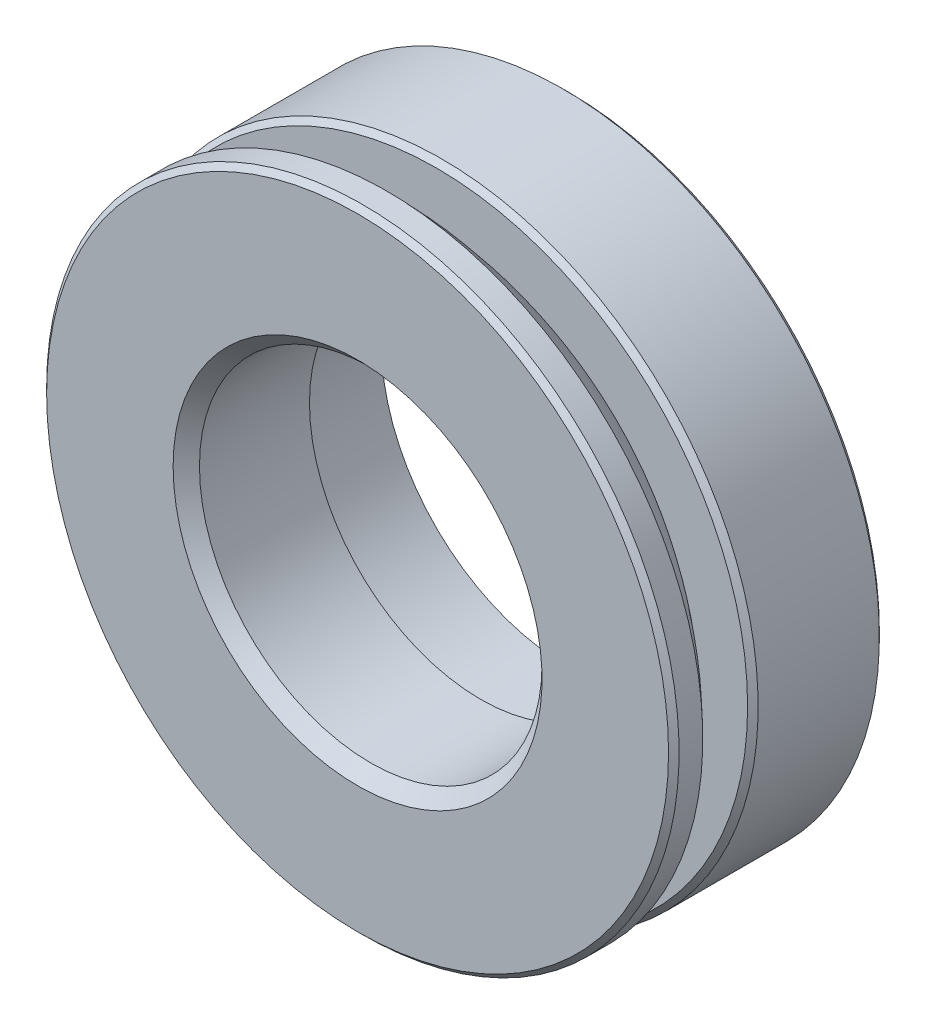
ISO-10303-21;
HEADER;
FILE_DESCRIPTION(('STEP AP214'),'2;1');
FILE_NAME('part.step','',(''),(''),'','','');
FILE_SCHEMA(('AUTOMOTIVE_DESIGN { 1 0 10303 214 1 1 1 1 }'));
ENDSEC;
DATA;
#1=APPLICATION_CONTEXT('core data for automotive mechanical design processes');
#2=APPLICATION_PROTOCOL_DEFINITION('international standard','automotive_design',2000,#1);
#3=PRODUCT_CONTEXT('',#1,'mechanical');
#4=PRODUCT('Part','Part','',(#3));
#5=PRODUCT_RELATED_PRODUCT_CATEGORY('part','',(#4));
#6=PRODUCT_DEFINITION_FORMATION('','',#4);
#7=PRODUCT_DEFINITION_CONTEXT('part definition',#1,'design');
#8=PRODUCT_DEFINITION('design','',#6,#7);
#9=PRODUCT_DEFINITION_SHAPE('','',#8);
#10=(LENGTH_UNIT() NAMED_UNIT(*) SI_UNIT(.MILLI.,.METRE.));
#11=(NAMED_UNIT(*) PLANE_ANGLE_UNIT() SI_UNIT($,.RADIAN.));
#12=(NAMED_UNIT(*) SI_UNIT($,.STERADIAN.) SOLID_ANGLE_UNIT());
#13=UNCERTAINTY_MEASURE_WITH_UNIT(LENGTH_MEASURE(1.E-05),#10,'distance_accuracy_value','');
#14=(GEOMETRIC_REPRESENTATION_CONTEXT(3) GLOBAL_UNCERTAINTY_ASSIGNED_CONTEXT((#13)) GLOBAL_UNIT_ASSIGNED_CONTEXT((#10,
#11,#12)) REPRESENTATION_CONTEXT('',''));
#15=CARTESIAN_POINT('',(0.,0.,0.));
#16=DIRECTION('',(0.,0.,1.));
#17=DIRECTION('',(1.,0.,0.));
#18=AXIS2_PLACEMENT_3D('',#15,#16,#17);
#19=CARTESIAN_POINT('',(6.5,0.,3.32568421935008));
#20=DIRECTION('',(0.,0.,1.));
#21=DIRECTION('',(-1.,0.,0.));
#22=AXIS2_PLACEMENT_3D('',#19,#20,#21);
#23=PLANE('',#22);
#24=CARTESIAN_POINT('',(0.,0.,3.32568421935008));
#25=DIRECTION('',(0.,0.,1.));
#26=DIRECTION('',(-1.,0.,0.));
#27=AXIS2_PLACEMENT_3D('',#24,#25,#26);
#28=CIRCLE('',#27,7.1);
#29=CARTESIAN_POINT('',(-7.1,0.,3.32568421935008));
#30=VERTEX_POINT('',#29);
#31=EDGE_CURVE('E8',#30,#30,#28,.T.);
#32=ORIENTED_EDGE('',*,*,#31,.F.);
#33=EDGE_LOOP('',(#32));
#34=FACE_BOUND('',#33,.T.);
#35=CARTESIAN_POINT('',(0.,0.,3.32568421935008));
#36=DIRECTION('',(0.,0.,1.));
#37=DIRECTION('',(-1.,0.,0.));
#38=AXIS2_PLACEMENT_3D('',#35,#36,#37);
#39=CIRCLE('',#38,6.5);
#40=CARTESIAN_POINT('',(-6.5,0.,3.32568421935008));
#41=VERTEX_POINT('',#40);
#42=EDGE_CURVE('E56',#41,#41,#39,.T.);
#43=ORIENTED_EDGE('',*,*,#42,.T.);
#44=EDGE_LOOP('',(#43));
#45=FACE_BOUND('',#44,.T.);
#46=ADVANCED_FACE('F13',(#34,#45),#23,.F.);
#47=CARTESIAN_POINT('',(0.,0.,10.4256842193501));
#48=DIRECTION('',(0.,0.,1.));
#49=DIRECTION('',(-1.,0.,0.));
#50=AXIS2_PLACEMENT_3D('',#47,#48,#49);
#51=CYLINDRICAL_SURFACE('',#50,7.1);
#52=CARTESIAN_POINT('',(0.,0.,0.));
#53=DIRECTION('',(0.,0.,1.));
#54=DIRECTION('',(-1.,0.,0.));
#55=AXIS2_PLACEMENT_3D('',#52,#53,#54);
#56=CIRCLE('',#55,7.1);
#57=CARTESIAN_POINT('',(-7.1,0.,0.));
#58=VERTEX_POINT('',#57);
#59=EDGE_CURVE('E19',#58,#58,#56,.T.);
#60=ORIENTED_EDGE('',*,*,#59,.F.);
#61=EDGE_LOOP('',(#60));
#62=FACE_BOUND('',#61,.T.);
#63=ORIENTED_EDGE('',*,*,#31,.T.);
#64=EDGE_LOOP('',(#63));
#65=FACE_BOUND('',#64,.T.);
#66=ADVANCED_FACE('F123',(#62,#65),#51,.F.);
#67=CARTESIAN_POINT('',(7.1,0.,0.));
#68=DIRECTION('',(0.,0.,1.));
#69=DIRECTION('',(-1.,0.,0.));
#70=AXIS2_PLACEMENT_3D('',#67,#68,#69);
#71=PLANE('',#70);
#72=CARTESIAN_POINT('',(0.,0.,0.));
#73=DIRECTION('',(0.,0.,1.));
#74=DIRECTION('',(-1.,0.,0.));
#75=AXIS2_PLACEMENT_3D('',#72,#73,#74);
#76=CIRCLE('',#75,11.8);
#77=CARTESIAN_POINT('',(-11.8,0.,0.));
#78=VERTEX_POINT('',#77);
#79=EDGE_CURVE('E23',#78,#78,#76,.T.);
#80=ORIENTED_EDGE('',*,*,#79,.F.);
#81=EDGE_LOOP('',(#80));
#82=FACE_BOUND('',#81,.T.);
#83=ORIENTED_EDGE('',*,*,#59,.T.);
#84=EDGE_LOOP('',(#83));
#85=FACE_BOUND('',#84,.T.);
#86=ADVANCED_FACE('F118',(#82,#85),#71,.F.);
#87=CARTESIAN_POINT('',(0.,0.,0.));
#88=DIRECTION('',(0.,0.,1.));
#89=DIRECTION('',(-1.,0.,0.));
#90=AXIS2_PLACEMENT_3D('',#87,#88,#89);
#91=CONICAL_SURFACE('',#90,11.8,0.785398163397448);
#92=CARTESIAN_POINT('',(0.,0.,0.2));
#93=DIRECTION('',(0.,0.,1.));
#94=DIRECTION('',(-1.,0.,0.));
#95=AXIS2_PLACEMENT_3D('',#92,#93,#94);
#96=CIRCLE('',#95,12.);
#97=CARTESIAN_POINT('',(-12.,0.,0.2));
#98=VERTEX_POINT('',#97);
#99=EDGE_CURVE('E27',#98,#98,#96,.T.);
#100=ORIENTED_EDGE('',*,*,#99,.F.);
#101=EDGE_LOOP('',(#100));
#102=FACE_BOUND('',#101,.T.);
#103=ORIENTED_EDGE('',*,*,#79,.T.);
#104=EDGE_LOOP('',(#103));
#105=FACE_BOUND('',#104,.T.);
#106=ADVANCED_FACE('F112',(#102,#105),#91,.T.);
#107=CARTESIAN_POINT('',(0.,0.,10.4256842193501));
#108=DIRECTION('',(0.,0.,1.));
#109=DIRECTION('',(-1.,0.,0.));
#110=AXIS2_PLACEMENT_3D('',#107,#108,#109);
#111=CYLINDRICAL_SURFACE('',#110,12.);
#112=CARTESIAN_POINT('',(0.,0.,4.8));
#113=DIRECTION('',(0.,0.,1.));
#114=DIRECTION('',(-1.,0.,0.));
#115=AXIS2_PLACEMENT_3D('',#112,#113,#114);
#116=CIRCLE('',#115,12.);
#117=CARTESIAN_POINT('',(-12.,0.,4.8));
#118=VERTEX_POINT('',#117);
#119=EDGE_CURVE('E32',#118,#118,#116,.T.);
#120=ORIENTED_EDGE('',*,*,#119,.F.);
#121=EDGE_LOOP('',(#120));
#122=FACE_BOUND('',#121,.T.);
#123=ORIENTED_EDGE('',*,*,#99,.T.);
#124=EDGE_LOOP('',(#123));
#125=FACE_BOUND('',#124,.T.);
#126=ADVANCED_FACE('F106',(#122,#125),#111,.T.);
#127=CARTESIAN_POINT('',(0.,0.,4.8));
#128=DIRECTION('',(0.,0.,-1.));
#129=DIRECTION('',(1.,0.,0.));
#130=AXIS2_PLACEMENT_3D('',#127,#128,#129);
#131=CONICAL_SURFACE('',#130,12.,0.785398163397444);
#132=CARTESIAN_POINT('',(0.,0.,5.));
#133=DIRECTION('',(0.,0.,1.));
#134=DIRECTION('',(-1.,0.,0.));
#135=AXIS2_PLACEMENT_3D('',#132,#133,#134);
#136=CIRCLE('',#135,11.8);
#137=CARTESIAN_POINT('',(-11.8,0.,5.));
#138=VERTEX_POINT('',#137);
#139=EDGE_CURVE('E35',#138,#138,#136,.T.);
#140=ORIENTED_EDGE('',*,*,#139,.F.);
#141=EDGE_LOOP('',(#140));
#142=FACE_BOUND('',#141,.T.);
#143=ORIENTED_EDGE('',*,*,#119,.T.);
#144=EDGE_LOOP('',(#143));
#145=FACE_BOUND('',#144,.T.);
#146=ADVANCED_FACE('F100',(#142,#145),#131,.T.);
#147=CARTESIAN_POINT('',(9.72824780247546,0.,5.));
#148=DIRECTION('',(0.,0.,-1.));
#149=DIRECTION('',(1.,0.,0.));
#150=AXIS2_PLACEMENT_3D('',#147,#148,#149);
#151=PLANE('',#150);
#152=CARTESIAN_POINT('',(0.,0.,5.));
#153=DIRECTION('',(0.,0.,1.));
#154=DIRECTION('',(-1.,0.,0.));
#155=AXIS2_PLACEMENT_3D('',#152,#153,#154);
#156=CIRCLE('',#155,9.72824780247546);
#157=CARTESIAN_POINT('',(-9.72824780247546,0.,5.));
#158=VERTEX_POINT('',#157);
#159=EDGE_CURVE('E38',#158,#158,#156,.T.);
#160=ORIENTED_EDGE('',*,*,#159,.F.);
#161=EDGE_LOOP('',(#160));
#162=FACE_BOUND('',#161,.T.);
#163=ORIENTED_EDGE('',*,*,#139,.T.);
#164=EDGE_LOOP('',(#163));
#165=FACE_BOUND('',#164,.T.);
#166=ADVANCED_FACE('F94',(#162,#165),#151,.F.);
#167=CARTESIAN_POINT('',(0.,0.,18.9408101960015));
#168=DIRECTION('',(0.,0.,1.));
#169=DIRECTION('',(-1.,0.,0.));
#170=AXIS2_PLACEMENT_3D('',#167,#168,#169);
#171=DEGENERATE_TOROIDAL_SURFACE('',#170,0.000771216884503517,17.,.F.);
#172=CARTESIAN_POINT('',(0.,0.,6.89998421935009));
#173=DIRECTION('',(0.,0.,1.));
#174=DIRECTION('',(-1.,0.,0.));
#175=AXIS2_PLACEMENT_3D('',#172,#173,#174);
#176=CIRCLE('',#175,12.);
#177=CARTESIAN_POINT('',(-12.,0.,6.89998421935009));
#178=VERTEX_POINT('',#177);
#179=EDGE_CURVE('E41',#178,#178,#176,.T.);
#180=ORIENTED_EDGE('',*,*,#179,.F.);
#181=EDGE_LOOP('',(#180));
#182=FACE_BOUND('',#181,.T.);
#183=ORIENTED_EDGE('',*,*,#159,.T.);
#184=EDGE_LOOP('',(#183));
#185=FACE_BOUND('',#184,.T.);
#186=ADVANCED_FACE('F88',(#182,#185),#171,.F.);
#187=CARTESIAN_POINT('',(0.,0.,10.4256842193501));
#188=DIRECTION('',(0.,0.,1.));
#189=DIRECTION('',(-1.,0.,0.));
#190=AXIS2_PLACEMENT_3D('',#187,#188,#189);
#191=CYLINDRICAL_SURFACE('',#190,12.);
#192=CARTESIAN_POINT('',(0.,0.,7.79998421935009));
#193=DIRECTION('',(0.,0.,1.));
#194=DIRECTION('',(-1.,0.,0.));
#195=AXIS2_PLACEMENT_3D('',#192,#193,#194);
#196=CIRCLE('',#195,12.);
#197=CARTESIAN_POINT('',(-12.,0.,7.79998421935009));
#198=VERTEX_POINT('',#197);
#199=EDGE_CURVE('E44',#198,#198,#196,.T.);
#200=ORIENTED_EDGE('',*,*,#199,.F.);
#201=EDGE_LOOP('',(#200));
#202=FACE_BOUND('',#201,.T.);
#203=ORIENTED_EDGE('',*,*,#179,.T.);
#204=EDGE_LOOP('',(#203));
#205=FACE_BOUND('',#204,.T.);
#206=ADVANCED_FACE('F82',(#202,#205),#191,.T.);
#207=CARTESIAN_POINT('',(0.,0.,7.79998421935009));
#208=DIRECTION('',(0.,0.,-1.));
#209=DIRECTION('',(1.,0.,0.));
#210=AXIS2_PLACEMENT_3D('',#207,#208,#209);
#211=CONICAL_SURFACE('',#210,12.,0.785398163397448);
#212=CARTESIAN_POINT('',(0.,0.,7.99998421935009));
#213=DIRECTION('',(0.,0.,1.));
#214=DIRECTION('',(-1.,0.,0.));
#215=AXIS2_PLACEMENT_3D('',#212,#213,#214);
#216=CIRCLE('',#215,11.8);
#217=CARTESIAN_POINT('',(-11.8,0.,7.99998421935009));
#218=VERTEX_POINT('',#217);
#219=EDGE_CURVE('E47',#218,#218,#216,.T.);
#220=ORIENTED_EDGE('',*,*,#219,.F.);
#221=EDGE_LOOP('',(#220));
#222=FACE_BOUND('',#221,.T.);
#223=ORIENTED_EDGE('',*,*,#199,.T.);
#224=EDGE_LOOP('',(#223));
#225=FACE_BOUND('',#224,.T.);
#226=ADVANCED_FACE('F76',(#222,#225),#211,.T.);
#227=CARTESIAN_POINT('',(11.8,0.,7.99998421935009));
#228=DIRECTION('',(0.,0.,-1.));
#229=DIRECTION('',(1.,0.,0.));
#230=AXIS2_PLACEMENT_3D('',#227,#228,#229);
#231=PLANE('',#230);
#232=CARTESIAN_POINT('',(0.,0.,7.99998421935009));
#233=DIRECTION('',(0.,0.,1.));
#234=DIRECTION('',(-1.,0.,0.));
#235=AXIS2_PLACEMENT_3D('',#232,#233,#234);
#236=CIRCLE('',#235,7.);
#237=CARTESIAN_POINT('',(-7.,0.,7.99998421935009));
#238=VERTEX_POINT('',#237);
#239=EDGE_CURVE('E50',#238,#238,#236,.T.);
#240=ORIENTED_EDGE('',*,*,#239,.F.);
#241=EDGE_LOOP('',(#240));
#242=FACE_BOUND('',#241,.T.);
#243=ORIENTED_EDGE('',*,*,#219,.T.);
#244=EDGE_LOOP('',(#243));
#245=FACE_BOUND('',#244,.T.);
#246=ADVANCED_FACE('F70',(#242,#245),#231,.F.);
#247=CARTESIAN_POINT('',(0.,0.,7.99998421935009));
#248=DIRECTION('',(0.,0.,1.));
#249=DIRECTION('',(-1.,0.,0.));
#250=AXIS2_PLACEMENT_3D('',#247,#248,#249);
#251=CONICAL_SURFACE('',#250,7.,0.785398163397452);
#252=CARTESIAN_POINT('',(0.,0.,7.49998421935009));
#253=DIRECTION('',(0.,0.,1.));
#254=DIRECTION('',(-1.,0.,0.));
#255=AXIS2_PLACEMENT_3D('',#252,#253,#254);
#256=CIRCLE('',#255,6.5);
#257=CARTESIAN_POINT('',(-6.5,0.,7.49998421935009));
#258=VERTEX_POINT('',#257);
#259=EDGE_CURVE('E53',#258,#258,#256,.T.);
#260=ORIENTED_EDGE('',*,*,#259,.F.);
#261=EDGE_LOOP('',(#260));
#262=FACE_BOUND('',#261,.T.);
#263=ORIENTED_EDGE('',*,*,#239,.T.);
#264=EDGE_LOOP('',(#263));
#265=FACE_BOUND('',#264,.T.);
#266=ADVANCED_FACE('F64',(#262,#265),#251,.F.);
#267=CARTESIAN_POINT('',(0.,0.,10.4256842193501));
#268=DIRECTION('',(0.,0.,1.));
#269=DIRECTION('',(-1.,0.,0.));
#270=AXIS2_PLACEMENT_3D('',#267,#268,#269);
#271=CYLINDRICAL_SURFACE('',#270,6.5);
#272=ORIENTED_EDGE('',*,*,#42,.F.);
#273=EDGE_LOOP('',(#272));
#274=FACE_BOUND('',#273,.T.);
#275=ORIENTED_EDGE('',*,*,#259,.T.);
#276=EDGE_LOOP('',(#275));
#277=FACE_BOUND('',#276,.T.);
#278=ADVANCED_FACE('F61',(#274,#277),#271,.F.);
#279=CLOSED_SHELL('',(#46,#66,#86,#106,#126,#146,#166,#186,#206,#226,#246,#266,#278));
#280=MANIFOLD_SOLID_BREP('B1',#279);
#281=ADVANCED_BREP_SHAPE_REPRESENTATION('',(#18,#280),#14);
#282=SHAPE_DEFINITION_REPRESENTATION(#9,#281);
ENDSEC;
END-ISO-10303-21;
